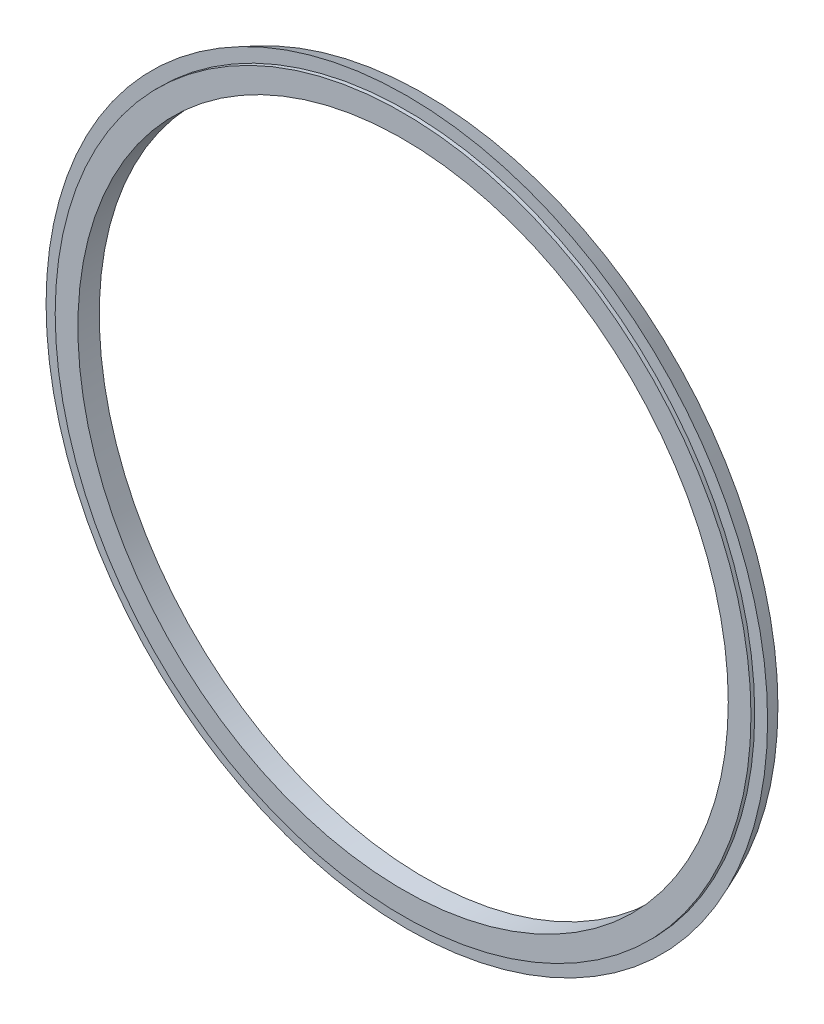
from build123d import *


with BuildPart() as part:
    # Sketch2 → Revolve2 (revolve)
    with BuildSketch(Plane(origin=(0, 0, 0), x_dir=(0, 0, -1), z_dir=(1, 0, 0)), mode=Mode.PRIVATE) as revolve2_sk:
        with BuildLine():
            Line((34.09588842, 97.503438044), (38.85838842, 95.530745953))
            Line((38.85838842, 95.530745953), (38.85838842, 93.349145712))
            Line((38.85838842, 93.349145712), (36.612728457, 93.950868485))
            ThreePointArc((36.612728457, 93.950868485), (36.392363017, 93.907035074), (36.29298842, 93.705523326))
            Line((36.29298842, 93.705523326), (36.29298842, 90.17574257))
            ThreePointArc((36.29298842, 90.17574257), (36.367383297, 89.996137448), (36.54698842, 89.92174257))
            Line((36.54698842, 89.92174257), (38.85838842, 89.92174257))
            Line((38.85838842, 89.92174257), (38.85838842, 87.88974257))
            Line((38.85838842, 87.88974257), (33.07988842, 87.88974257))
            Line((33.07988842, 87.88974257), (33.07988842, 94.02111757))
            Line((33.07988842, 94.02111757), (34.09588842, 94.02111757))
            Line((34.09588842, 94.02111757), (34.09588842, 97.503438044))
        make_face()
    revolve(revolve2_sk.sketch.rotate(Axis((0, 0, 5.08), (0, 0, -1)), 90), axis=Axis((0, 0, 5.08), (0, 0, -1)))


solid = part.part
